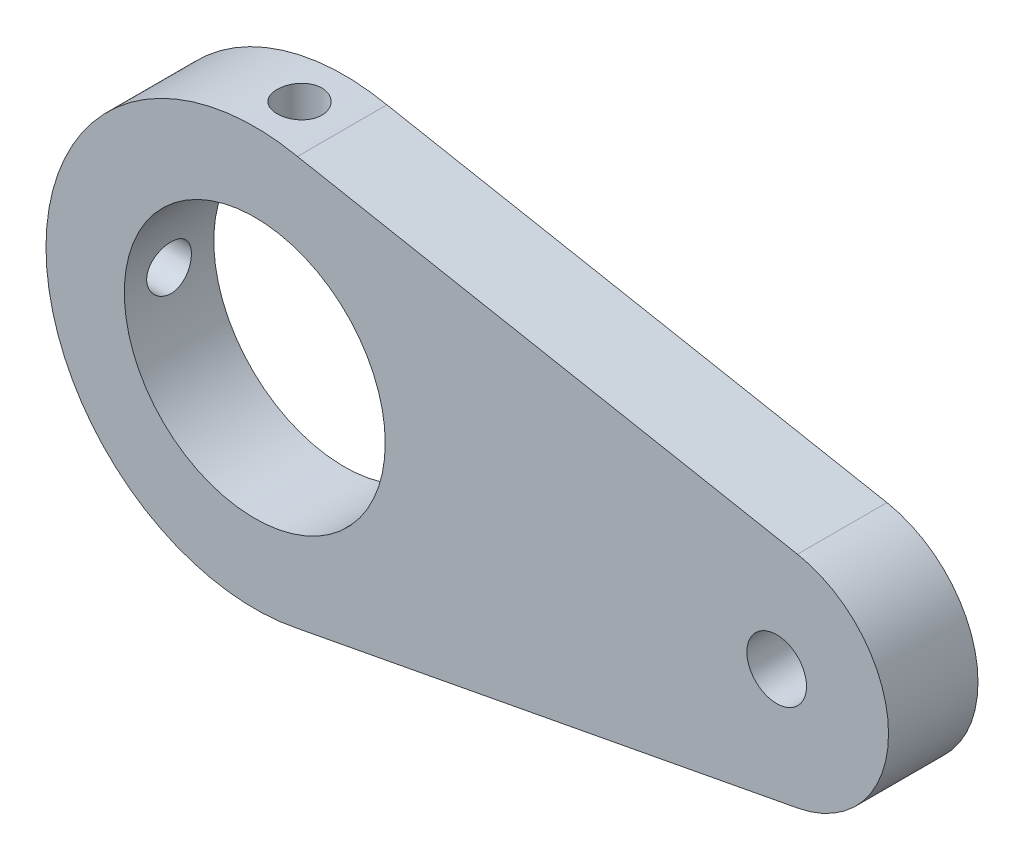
from build123d import *

# Parameters (mm, degrees)
SKETCH_1_R          = 17.5
SKETCH_1_R_2        = 4
EXTRUDE_1_DEPTH     = 12
SKETCH_2_R          = 3
CUT_EXTRUDE_1_DEPTH = 12
SKETCH_3_R          = 3
CUT_EXTRUDE_3_DEPTH = 19


with BuildPart() as part:
    # Sketch 1 → Extrude 1 (new body)
    with BuildSketch(Plane.XY):
        with BuildLine():
            Line((5.725591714, 27.408349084), (72.784606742, 14.739266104))
            ThreePointArc((72.784606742, 14.739266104), (85, 0), (72.784606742, -14.739266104))
            Line((72.784606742, -14.739266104), (5.725591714, -27.408349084))
            ThreePointArc((5.725591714, -27.408349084), (-28, 0), (5.725591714, 27.408349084))
        make_face()
        Circle(SKETCH_1_R, mode=Mode.SUBTRACT)
        with Locations((70, 0)):
            Circle(SKETCH_1_R_2, mode=Mode.SUBTRACT)
    extrude(amount=EXTRUDE_1_DEPTH)

    # Sketch 2 → Cut-Extrude 1 (cut)
    with BuildSketch(Plane(origin=(0, 28, 0), x_dir=(1, 0, 0), z_dir=(0, 1, 0))):
        with Locations(Location((0, -6, 0), (0, 0, 270))):
            Circle(SKETCH_2_R)
    extrude(amount=-CUT_EXTRUDE_1_DEPTH, mode=Mode.SUBTRACT)

    # Sketch 3 → Cut-Extrude 3 (cut)
    with BuildSketch(Plane(origin=(-28, 0, 0), x_dir=(0, 0, -1), z_dir=(1, 0, 0))):
        with Locations(Location((-6, 0, 0), (0, 0, 180))):
            Circle(SKETCH_3_R)
    extrude(amount=CUT_EXTRUDE_3_DEPTH, mode=Mode.SUBTRACT)


solid = part.part
